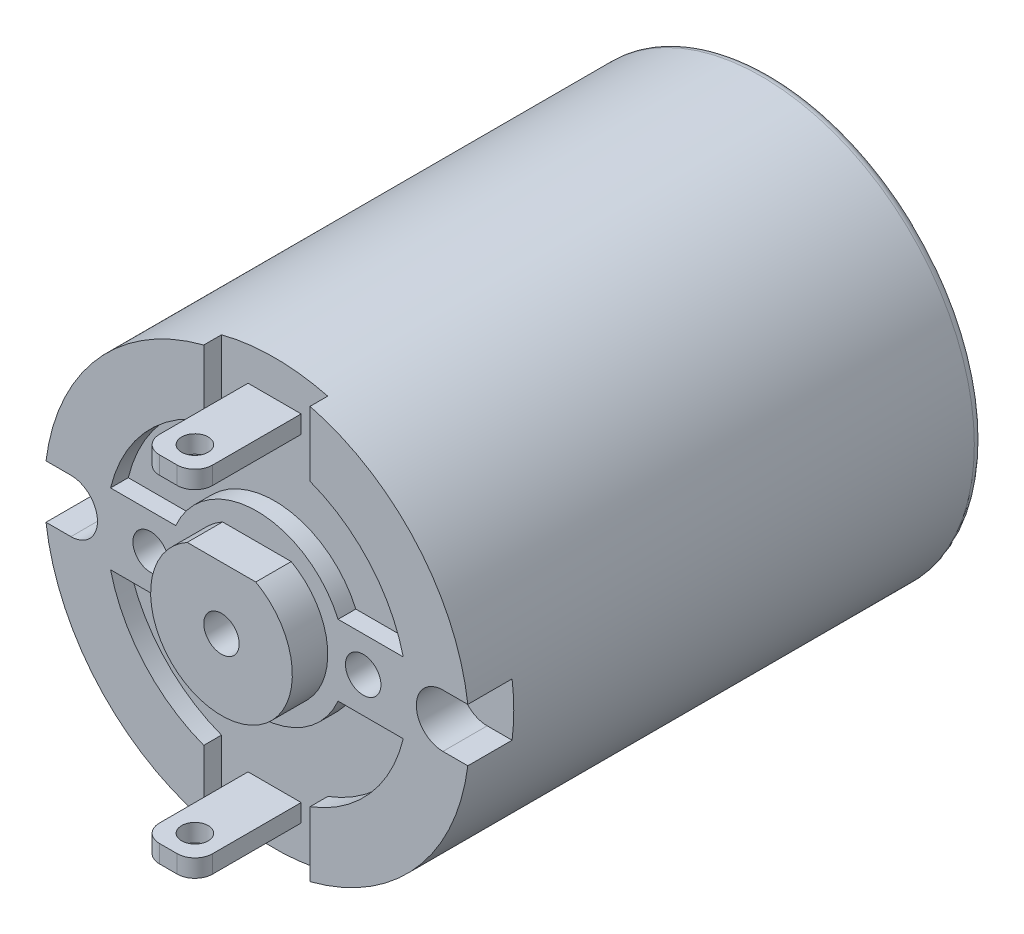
from build123d import *

# Parameters (mm, degrees)
ESQUISSE1_R                               = 12
CORPS_CYLINDRIQUE_DEPTH                   = 29
ESQUISSE4_R                               = 3
BOSSAGE_AVANT_DEPTH                       = 2
ESQUISSE5_R                               = 1
TARAUDAGES_FIXATION_MOTEUR_DEPTH          = 2
CONG_AVANT_R                              = 0.5
PER_AGE_AXE_MOTEUR_DEPTH                  = 10
PER_AGE_AXE_MOTEUR_DEPTH_BACK             = 34.600595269
ESQUISSE3_R                               = 1
ESQUISSE7_W                               = 4
ESQUISSE7_H                               = 1
EMBOUTISSAGES_AVANT_DEPTH                 = 1
CONG_S_EMBOUTISSAGES_R                    = 0.3
FORMES_ARRI_RES_DEPTH                     = 1
ESQUISSE10_R                              = 4
CENTREUR_DEPTH                            = 2
ESQUISSE11_R                              = 1
PER_AGES_ARRI_RES_DEPTH                   = 4
ESQUISSE12_R                              = 1
PER_AGE_CENTRAL_DEPTH                     = 38.107950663
ESQUISSE13_W                              = 12
ESQUISSE13_H                              = 2.5
M_PLAT_ARRI_RE_DEPTH                      = 2
ESQUISSE14_W                              = 6
ESQUISSE14_H                              = 11
PASSAGES_PATTES_LECTRIQUES_DEPTH          = 1
ESQUISSE15_W                              = 3
ESQUISSE15_H                              = 1
PATTE_LECTRIQUE_DEPTH                     = 6
CONG_S_PATTE_R                            = 1
ESQUISSE16_R                              = 0.75
PER_AGE_PATTE_DEPTH                       = 42.72529209
CONG_S_PATTE_OF_SYM_TRIE_PATTE_LECTRIQU_R = 1
ENCOCHE_DEPTH                             = 2.5


with BuildPart() as part:
    # Esquisse1 → Corps cylindrique (new body)
    with BuildSketch(Plane.XY):
        with Locations(Location((0, 0, 0), (0, 0, 180))):
            Circle(ESQUISSE1_R)
    extrude(amount=CORPS_CYLINDRIQUE_DEPTH)

    # Esquisse4 → Bossage avant (add)
    with BuildSketch(Plane(origin=(0, 0, 0), x_dir=(-1, 0, 0), z_dir=(0, 0, -1))):
        with Locations(Location((0, 0, 0), (0, 0, 180))):
            Circle(ESQUISSE4_R)
    extrude(amount=BOSSAGE_AVANT_DEPTH)

    # Esquisse5 → Taraudages fixation moteur (cut)
    with BuildSketch(Plane(origin=(0, 0, 0), x_dir=(-1, 0, 0), z_dir=(0, 0, -1))):
        with Locations((7, 0)):
            Circle(ESQUISSE5_R)
        with Locations((-7, 0)):
            Circle(ESQUISSE5_R)
    extrude(amount=-TARAUDAGES_FIXATION_MOTEUR_DEPTH, mode=Mode.SUBTRACT)

    # Cong_ avant
    cong_avant_edges = [part.edges().sort_by_distance(p)[0] for p in [
        (12, 0, 0),
    ]]
    fillet(cong_avant_edges, radius=CONG_AVANT_R)

    # Esquisse3 → Per_age axe moteur (cut, two sides: drawn at the far end of the back side and taken through both)
    with BuildSketch(Plane(origin=(0, 0, 0), x_dir=(-1, 0, 0), z_dir=(0, 0, -1)).offset(-PER_AGE_AXE_MOTEUR_DEPTH_BACK)):
        Circle(ESQUISSE3_R)
    extrude(amount=PER_AGE_AXE_MOTEUR_DEPTH + PER_AGE_AXE_MOTEUR_DEPTH_BACK, mode=Mode.SUBTRACT)

    # Esquisse7 → Emboutissages avant (cut)
    with BuildSketch(Plane(origin=(0, 0, 0), x_dir=(-1, 0, 0), z_dir=(0, 0, -1))):
        with Locations((0, 9.5)):
            Rectangle(ESQUISSE7_W, ESQUISSE7_H)
        with Locations((0, -9.5)):
            Rectangle(ESQUISSE7_W, ESQUISSE7_H)
    extrude(amount=-EMBOUTISSAGES_AVANT_DEPTH, mode=Mode.SUBTRACT)

    # Cong_s emboutissages
    cong_s_emboutissages_edges = [part.edges().sort_by_distance(p)[0] for p in [
        (2, 9.5, 1),
        (-2, 9.5, 1),
        (2, 9.5, 0),
        (-2, 9.5, 0),
        (2, -9.5, 1),
        (-2, -9.5, 1),
        (2, -9.5, 0),
        (-2, -9.5, 0),
    ]]
    fillet(cong_s_emboutissages_edges, radius=CONG_S_EMBOUTISSAGES_R)

    # Esquisse9 → Formes arri_res (cut)
    with BuildSketch(Plane.XY.offset(29)):
        with BuildLine():
            Line((4.582575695, 2), (8.261355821, 2))
            ThreePointArc((8.261355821, 2), (0, 8.5), (-8.261355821, 2))
            Line((-8.261355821, 2), (-4.582575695, 2))
            ThreePointArc((-4.582575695, 2), (0, 5), (4.582575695, 2))
        make_face()
        with BuildLine():
            Line((4.582575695, -2), (8.261355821, -2))
            ThreePointArc((8.261355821, -2), (0, -8.5), (-8.261355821, -2))
            Line((-8.261355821, -2), (-4.582575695, -2))
            ThreePointArc((-4.582575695, -2), (0, -5), (4.582575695, -2))
        make_face()
    extrude(amount=-FORMES_ARRI_RES_DEPTH, mode=Mode.SUBTRACT)

    # Esquisse10 → Centreur (add)
    with BuildSketch(Plane.XY.offset(29)):
        Circle(ESQUISSE10_R)
    extrude(amount=CENTREUR_DEPTH)

    # Esquisse11 → Per_ages arri_res (cut)
    with BuildSketch(Plane.XY.offset(29)):
        with Locations((-6, 0)):
            Circle(ESQUISSE11_R)
        with Locations((6, 0)):
            Circle(ESQUISSE11_R)
    extrude(amount=-PER_AGES_ARRI_RES_DEPTH, mode=Mode.SUBTRACT)

    # Esquisse12 → Per_age central (cut, through all)
    with BuildSketch(Plane.XY.offset(31)):
        with Locations(Location((0, 0, 0), (0, 0, 180))):
            Circle(ESQUISSE12_R)
    extrude(amount=-PER_AGE_CENTRAL_DEPTH, mode=Mode.SUBTRACT)

    # Esquisse13 → M_plat arri_re (cut)
    with BuildSketch(Plane.XY.offset(31)):
        with Locations((0, 4.75)):
            Rectangle(ESQUISSE13_W, ESQUISSE13_H)
    extrude(amount=-M_PLAT_ARRI_RE_DEPTH, mode=Mode.SUBTRACT)

    # Esquisse14 → Passages pattes _lectriques (cut)
    with BuildSketch(Plane.XY.offset(29)):
        with Locations((0, 12.5)):
            Rectangle(ESQUISSE14_W, ESQUISSE14_H)
    passages_pattes_lectriques = extrude(amount=-PASSAGES_PATTES_LECTRIQUES_DEPTH, mode=Mode.SUBTRACT)

    # Esquisse15 → Patte _lectrique (add)
    with BuildSketch(Plane.XY.offset(28)):
        with Locations((0, 9.5)):
            Rectangle(ESQUISSE15_W, ESQUISSE15_H)
    patte_lectrique = extrude(amount=PATTE_LECTRIQUE_DEPTH)

    # Cong_s patte
    cong_s_patte_edges = [part.edges().sort_by_distance(p)[0] for p in [
        (-1.5, 9.5, 34),
        (1.5, 9.5, 34),
    ]]
    fillet(cong_s_patte_edges, radius=CONG_S_PATTE_R)

    # Esquisse16 → Per_age patte (cut, through all)
    with BuildSketch(Plane.XZ.offset(-9)):
        with Locations(Location((0, 32.5, 0), (0, 0, 270))):
            Circle(ESQUISSE16_R)
    per_age_patte = extrude(amount=-PER_AGE_PATTE_DEPTH, mode=Mode.SUBTRACT)

    # Sym_trie patte _lectrique: Passages pattes _lectriques, Patte _lectrique, Per_age patte across plane
    add(passages_pattes_lectriques.mirror(Plane.ZX), mode=Mode.SUBTRACT)
    add(patte_lectrique.mirror(Plane.ZX))
    add(per_age_patte.mirror(Plane.ZX), mode=Mode.SUBTRACT)

    # Cong_s patte of Sym_trie patte _lectriqu
    cong_s_patte_of_sym_trie_patte_lectriqu_edges = [part.edges().sort_by_distance(p)[0] for p in [
        (-1.5, -9.5, 34),
        (1.5, -9.5, 34),
    ]]
    fillet(cong_s_patte_of_sym_trie_patte_lectriqu_edges, radius=CONG_S_PATTE_OF_SYM_TRIE_PATTE_LECTRIQU_R)

    # Esquisse17 → Encoche (cut)
    with BuildSketch(Plane.XY.offset(29)):
        with BuildLine():
            Line((10.5, 1.5), (16, 1.5))
            Line((16, 1.5), (16, -1.5))
            Line((16, -1.5), (10.5, -1.5))
            ThreePointArc((10.5, -1.5), (9, 0), (10.5, 1.5))
        make_face()
    encoche = extrude(amount=-ENCOCHE_DEPTH, mode=Mode.SUBTRACT)

    # Sym_trie encoche: Encoche across plane
    add(encoche.mirror(Plane(origin=(0, 0, 0), x_dir=(0, 0, 1), z_dir=(1, 0, 0))), mode=Mode.SUBTRACT)


solid = part.part
